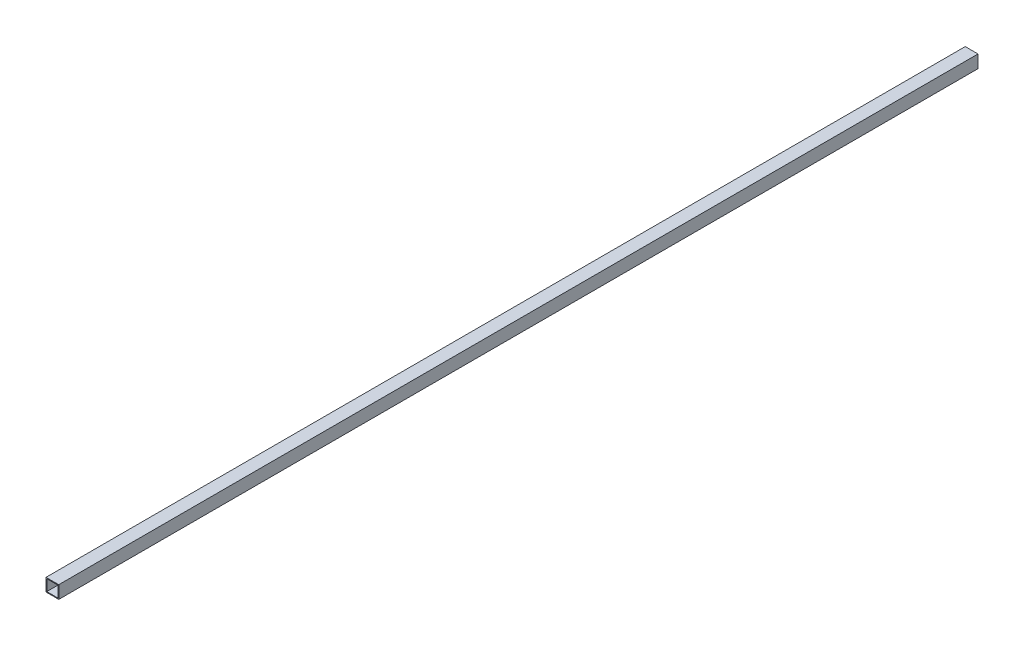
from build123d import *

# Parameters (mm, degrees)
SKETCH1_W           = 50.8
SKETCH1_H           = 50.8
SKETCH1_W_2         = 44.45
SKETCH1_H_2         = 44.45
BOSS_EXTRUDE1_DEPTH = 3657.6


with BuildPart() as part:
    # Sketch1 → Boss-Extrude1 (new body)
    with BuildSketch(Plane.XY.offset(3657.6)):
        Rectangle(SKETCH1_W, SKETCH1_H)
        Rectangle(SKETCH1_W_2, SKETCH1_H_2, mode=Mode.SUBTRACT)
    extrude(amount=-BOSS_EXTRUDE1_DEPTH)


solid = part.part
